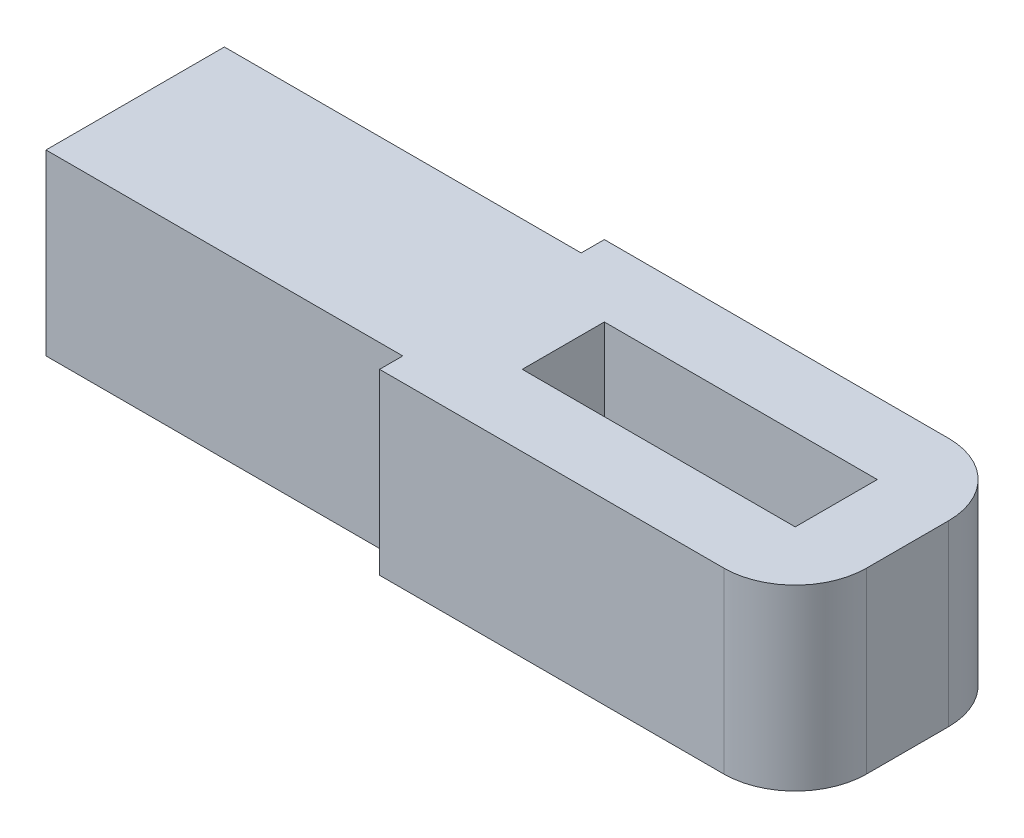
from build123d import *

# Parameters (mm, degrees)
ESQUISSE1_W        = 11.65
ESQUISSE1_H        = 6.3
ESQUISSE1_W_2      = 7.65
ESQUISSE1_H_2      = 2.3
BOSS_EXTRU_1_DEPTH = 5
CONG_1_R           = 2
ESQUISSE3_W        = 10
ESQUISSE3_H        = 5
BOSS_EXTRU_2_DEPTH = 5


with BuildPart() as part:
    # Esquisse1 → Boss.-Extru.1 (new body)
    with BuildSketch(Plane(origin=(0, 0, 0), x_dir=(1, 0, 0), z_dir=(0, 1, 0))):
        Rectangle(ESQUISSE1_W, ESQUISSE1_H)
        Rectangle(ESQUISSE1_W_2, ESQUISSE1_H_2, mode=Mode.SUBTRACT)
    extrude(amount=BOSS_EXTRU_1_DEPTH)

    # Cong_1
    cong_1_edges = [part.edges().sort_by_distance(p)[0] for p in [
        (5.825, 2.5, 3.15),
        (5.825, 2.5, -3.15),
    ]]
    fillet(cong_1_edges, radius=CONG_1_R)

    # Esquisse3 → Boss.-Extru.2 (add)
    with BuildSketch(Plane(origin=(0, 5, 0), x_dir=(1, 0, 0), z_dir=(0, 1, 0))):
        with Locations((-10.825, 0)):
            Rectangle(ESQUISSE3_W, ESQUISSE3_H)
    extrude(amount=-BOSS_EXTRU_2_DEPTH)


solid = part.part
